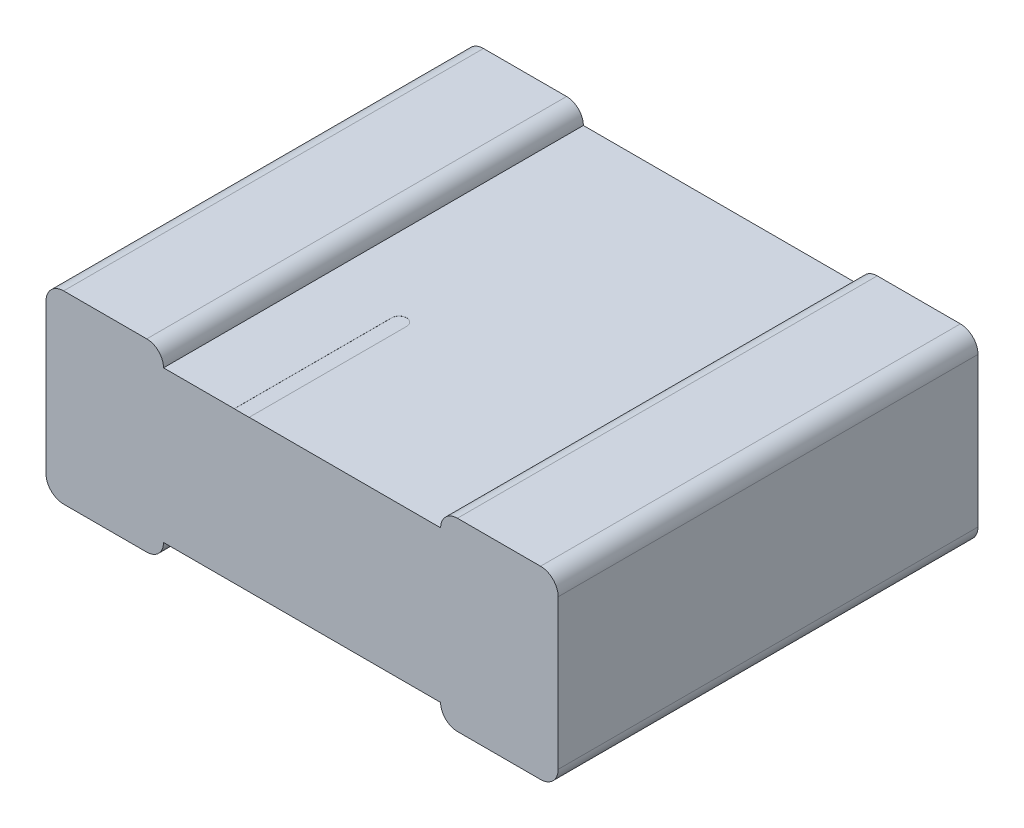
ISO-10303-21;
HEADER;
FILE_DESCRIPTION(('STEP AP214'),'2;1');
FILE_NAME('part.step','',(''),(''),'','','');
FILE_SCHEMA(('AUTOMOTIVE_DESIGN { 1 0 10303 214 1 1 1 1 }'));
ENDSEC;
DATA;
#1=APPLICATION_CONTEXT('core data for automotive mechanical design processes');
#2=APPLICATION_PROTOCOL_DEFINITION('international standard','automotive_design',2000,#1);
#3=PRODUCT_CONTEXT('',#1,'mechanical');
#4=PRODUCT('Part','Part','',(#3));
#5=PRODUCT_RELATED_PRODUCT_CATEGORY('part','',(#4));
#6=PRODUCT_DEFINITION_FORMATION('','',#4);
#7=PRODUCT_DEFINITION_CONTEXT('part definition',#1,'design');
#8=PRODUCT_DEFINITION('design','',#6,#7);
#9=PRODUCT_DEFINITION_SHAPE('','',#8);
#10=(LENGTH_UNIT() NAMED_UNIT(*) SI_UNIT(.MILLI.,.METRE.));
#11=(NAMED_UNIT(*) PLANE_ANGLE_UNIT() SI_UNIT($,.RADIAN.));
#12=(NAMED_UNIT(*) SI_UNIT($,.STERADIAN.) SOLID_ANGLE_UNIT());
#13=UNCERTAINTY_MEASURE_WITH_UNIT(LENGTH_MEASURE(1.E-05),#10,'distance_accuracy_value','');
#14=(GEOMETRIC_REPRESENTATION_CONTEXT(3) GLOBAL_UNCERTAINTY_ASSIGNED_CONTEXT((#13)) GLOBAL_UNIT_ASSIGNED_CONTEXT((#10,
#11,#12)) REPRESENTATION_CONTEXT('',''));
#15=CARTESIAN_POINT('',(0.,0.,0.));
#16=DIRECTION('',(0.,0.,1.));
#17=DIRECTION('',(1.,0.,0.));
#18=AXIS2_PLACEMENT_3D('',#15,#16,#17);
#19=CARTESIAN_POINT('',(0.,0.,0.));
#20=DIRECTION('',(0.,1.,0.));
#21=DIRECTION('',(0.,0.,1.));
#22=AXIS2_PLACEMENT_3D('',#19,#20,#21);
#23=PLANE('',#22);
#24=DIRECTION('',(0.,0.,1.));
#25=VECTOR('',#24,1.);
#26=CARTESIAN_POINT('',(0.4191,0.,-0.635));
#27=LINE('',#26,#25);
#28=CARTESIAN_POINT('',(0.4191,0.,0.635));
#29=VERTEX_POINT('',#28);
#30=CARTESIAN_POINT('',(0.4191,0.,-0.635));
#31=VERTEX_POINT('',#30);
#32=EDGE_CURVE('E377',#29,#31,#27,.F.);
#33=ORIENTED_EDGE('',*,*,#32,.F.);
#34=DIRECTION('',(1.,0.,0.));
#35=VECTOR('',#34,1.);
#36=CARTESIAN_POINT('',(-0.7239,0.,0.635));
#37=LINE('',#36,#35);
#38=CARTESIAN_POINT('',(-0.4191,0.,0.635));
#39=VERTEX_POINT('',#38);
#40=EDGE_CURVE('E475',#39,#29,#37,.T.);
#41=ORIENTED_EDGE('',*,*,#40,.F.);
#42=DIRECTION('',(0.,0.,1.));
#43=VECTOR('',#42,1.);
#44=CARTESIAN_POINT('',(-0.4191,0.,-0.635));
#45=LINE('',#44,#43);
#46=CARTESIAN_POINT('',(-0.4191,0.,-0.635));
#47=VERTEX_POINT('',#46);
#48=EDGE_CURVE('E463',#47,#39,#45,.T.);
#49=ORIENTED_EDGE('',*,*,#48,.F.);
#50=DIRECTION('',(-1.,0.,0.));
#51=VECTOR('',#50,1.);
#52=CARTESIAN_POINT('',(-0.7239,0.,-0.635));
#53=LINE('',#52,#51);
#54=EDGE_CURVE('E478',#31,#47,#53,.T.);
#55=ORIENTED_EDGE('',*,*,#54,.F.);
#56=EDGE_LOOP('',(#33,#41,#49,#55));
#57=FACE_BOUND('',#56,.T.);
#58=ADVANCED_FACE('F14',(#57),#23,.F.);
#59=CARTESIAN_POINT('',(-0.7239,0.4572,0.635));
#60=DIRECTION('',(0.,0.,-1.));
#61=DIRECTION('',(-1.,0.,0.));
#62=AXIS2_PLACEMENT_3D('',#59,#60,#61);
#63=PLANE('',#62);
#64=DIRECTION('',(1.,0.,0.));
#65=VECTOR('',#64,1.);
#66=CARTESIAN_POINT('',(-0.721360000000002,-0.0508000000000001,0.635));
#67=LINE('',#66,#65);
#68=CARTESIAN_POINT('',(-0.721360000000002,-0.0508000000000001,0.635));
#69=VERTEX_POINT('',#68);
#70=CARTESIAN_POINT('',(-0.469900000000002,-0.0508000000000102,0.635));
#71=VERTEX_POINT('',#70);
#72=EDGE_CURVE('E427',#69,#71,#67,.T.);
#73=ORIENTED_EDGE('',*,*,#72,.T.);
#74=CARTESIAN_POINT('',(-0.4699,0.,0.635));
#75=DIRECTION('',(0.,0.,-1.));
#76=DIRECTION('',(-1.,0.,0.));
#77=AXIS2_PLACEMENT_3D('',#74,#75,#76);
#78=CIRCLE('',#77,0.0508);
#79=EDGE_CURVE('E488',#71,#39,#78,.F.);
#80=ORIENTED_EDGE('',*,*,#79,.T.);
#81=ORIENTED_EDGE('',*,*,#40,.T.);
#82=CARTESIAN_POINT('',(0.4699,0.,0.635));
#83=DIRECTION('',(0.,0.,-1.));
#84=DIRECTION('',(-1.,0.,0.));
#85=AXIS2_PLACEMENT_3D('',#82,#83,#84);
#86=CIRCLE('',#85,0.0508);
#87=CARTESIAN_POINT('',(0.469900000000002,-0.0508000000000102,0.635));
#88=VERTEX_POINT('',#87);
#89=EDGE_CURVE('E490',#29,#88,#86,.F.);
#90=ORIENTED_EDGE('',*,*,#89,.T.);
#91=DIRECTION('',(-1.,0.,0.));
#92=VECTOR('',#91,1.);
#93=CARTESIAN_POINT('',(0.721360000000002,-0.0508000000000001,0.635));
#94=LINE('',#93,#92);
#95=CARTESIAN_POINT('',(0.721360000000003,-0.0508000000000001,0.635));
#96=VERTEX_POINT('',#95);
#97=EDGE_CURVE('E346',#96,#88,#94,.T.);
#98=ORIENTED_EDGE('',*,*,#97,.F.);
#99=CARTESIAN_POINT('',(0.72136,0.00254000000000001,0.635));
#100=DIRECTION('',(0.,0.,-1.));
#101=DIRECTION('',(1.,0.,0.));
#102=AXIS2_PLACEMENT_3D('',#99,#100,#101);
#103=CIRCLE('',#102,0.0533400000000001);
#104=CARTESIAN_POINT('',(0.7747,0.00254000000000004,0.635));
#105=VERTEX_POINT('',#104);
#106=EDGE_CURVE('E370',#105,#96,#103,.T.);
#107=ORIENTED_EDGE('',*,*,#106,.F.);
#108=DIRECTION('',(0.,-1.,0.));
#109=VECTOR('',#108,1.);
#110=CARTESIAN_POINT('',(0.7747,0.45466,0.635));
#111=LINE('',#110,#109);
#112=CARTESIAN_POINT('',(0.774699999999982,0.45466,0.635));
#113=VERTEX_POINT('',#112);
#114=EDGE_CURVE('E363',#113,#105,#111,.T.);
#115=ORIENTED_EDGE('',*,*,#114,.F.);
#116=CARTESIAN_POINT('',(0.72136,0.45466,0.635));
#117=DIRECTION('',(0.,0.,-1.));
#118=DIRECTION('',(3.638398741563E-13,1.,0.));
#119=AXIS2_PLACEMENT_3D('',#116,#117,#118);
#120=CIRCLE('',#119,0.053339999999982);
#121=CARTESIAN_POINT('',(0.72136,0.508,0.635));
#122=VERTEX_POINT('',#121);
#123=EDGE_CURVE('E356',#122,#113,#120,.T.);
#124=ORIENTED_EDGE('',*,*,#123,.F.);
#125=DIRECTION('',(1.,0.,0.));
#126=VECTOR('',#125,1.);
#127=CARTESIAN_POINT('',(0.4191,0.508,0.635));
#128=LINE('',#127,#126);
#129=CARTESIAN_POINT('',(0.469899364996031,0.508,0.635));
#130=VERTEX_POINT('',#129);
#131=EDGE_CURVE('E351',#130,#122,#128,.T.);
#132=ORIENTED_EDGE('',*,*,#131,.F.);
#133=CARTESIAN_POINT('',(0.469899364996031,0.4572,0.635));
#134=DIRECTION('',(0.,0.,-1.));
#135=DIRECTION('',(-1.,0.,0.));
#136=AXIS2_PLACEMENT_3D('',#133,#134,#135);
#137=CIRCLE('',#136,0.0508);
#138=CARTESIAN_POINT('',(0.4191,0.457454,0.635));
#139=VERTEX_POINT('',#138);
#140=EDGE_CURVE('E482',#130,#139,#137,.F.);
#141=ORIENTED_EDGE('',*,*,#140,.T.);
#142=DIRECTION('',(1.,0.,0.));
#143=VECTOR('',#142,1.);
#144=CARTESIAN_POINT('',(0.4191,0.457454,0.635));
#145=LINE('',#144,#143);
#146=CARTESIAN_POINT('',(-0.160003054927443,0.457454,0.635));
#147=VERTEX_POINT('',#146);
#148=EDGE_CURVE('E293',#147,#139,#145,.T.);
#149=ORIENTED_EDGE('',*,*,#148,.F.);
#150=DIRECTION('',(0.,-1.,0.));
#151=VECTOR('',#150,1.);
#152=CARTESIAN_POINT('',(-0.160003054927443,3.05727304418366,0.635));
#153=LINE('',#152,#151);
#154=CARTESIAN_POINT('',(-0.160003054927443,0.4572,0.635));
#155=VERTEX_POINT('',#154);
#156=EDGE_CURVE('E543',#147,#155,#153,.T.);
#157=ORIENTED_EDGE('',*,*,#156,.T.);
#158=DIRECTION('',(1.,0.,0.));
#159=VECTOR('',#158,1.);
#160=CARTESIAN_POINT('',(0.4191,0.4572,0.635));
#161=LINE('',#160,#159);
#162=CARTESIAN_POINT('',(-0.205099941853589,0.4572,0.635));
#163=VERTEX_POINT('',#162);
#164=EDGE_CURVE('E276',#163,#155,#161,.T.);
#165=ORIENTED_EDGE('',*,*,#164,.F.);
#166=DIRECTION('',(0.,-1.,0.));
#167=VECTOR('',#166,1.);
#168=CARTESIAN_POINT('',(-0.205099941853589,3.05727304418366,0.635));
#169=LINE('',#168,#167);
#170=CARTESIAN_POINT('',(-0.205099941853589,0.457454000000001,0.635));
#171=VERTEX_POINT('',#170);
#172=EDGE_CURVE('E267',#171,#163,#169,.T.);
#173=ORIENTED_EDGE('',*,*,#172,.F.);
#174=CARTESIAN_POINT('',(-0.4191,0.457454,0.635));
#175=VERTEX_POINT('',#174);
#176=EDGE_CURVE('E282',#175,#171,#145,.T.);
#177=ORIENTED_EDGE('',*,*,#176,.F.);
#178=CARTESIAN_POINT('',(-0.469899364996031,0.4572,0.635));
#179=DIRECTION('',(0.,0.,-1.));
#180=DIRECTION('',(-1.,0.,0.));
#181=AXIS2_PLACEMENT_3D('',#178,#179,#180);
#182=CIRCLE('',#181,0.0508);
#183=CARTESIAN_POINT('',(-0.469899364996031,0.508,0.635));
#184=VERTEX_POINT('',#183);
#185=EDGE_CURVE('E485',#175,#184,#182,.F.);
#186=ORIENTED_EDGE('',*,*,#185,.T.);
#187=DIRECTION('',(-1.,0.,0.));
#188=VECTOR('',#187,1.);
#189=CARTESIAN_POINT('',(-0.4191,0.508,0.635));
#190=LINE('',#189,#188);
#191=CARTESIAN_POINT('',(-0.72136,0.508,0.635));
#192=VERTEX_POINT('',#191);
#193=EDGE_CURVE('E393',#184,#192,#190,.T.);
#194=ORIENTED_EDGE('',*,*,#193,.T.);
#195=CARTESIAN_POINT('',(-0.72136,0.45466,0.635));
#196=DIRECTION('',(0.,0.,1.));
#197=DIRECTION('',(-3.638398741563E-13,1.,0.));
#198=AXIS2_PLACEMENT_3D('',#195,#196,#197);
#199=CIRCLE('',#198,0.053339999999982);
#200=CARTESIAN_POINT('',(-0.774699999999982,0.45466,0.635));
#201=VERTEX_POINT('',#200);
#202=EDGE_CURVE('E401',#192,#201,#199,.T.);
#203=ORIENTED_EDGE('',*,*,#202,.T.);
#204=DIRECTION('',(0.,-1.,0.));
#205=VECTOR('',#204,1.);
#206=CARTESIAN_POINT('',(-0.7747,0.45466,0.635));
#207=LINE('',#206,#205);
#208=CARTESIAN_POINT('',(-0.7747,0.00254000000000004,0.635));
#209=VERTEX_POINT('',#208);
#210=EDGE_CURVE('E411',#201,#209,#207,.T.);
#211=ORIENTED_EDGE('',*,*,#210,.T.);
#212=CARTESIAN_POINT('',(-0.72136,0.00254000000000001,0.635));
#213=DIRECTION('',(0.,0.,1.));
#214=DIRECTION('',(-1.,0.,0.));
#215=AXIS2_PLACEMENT_3D('',#212,#213,#214);
#216=CIRCLE('',#215,0.0533400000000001);
#217=EDGE_CURVE('E421',#209,#69,#216,.T.);
#218=ORIENTED_EDGE('',*,*,#217,.T.);
#219=EDGE_LOOP('',(#73,#80,#81,#90,#98,#107,#115,#124,#132,#141,#149,#157,#165,#173,#177,#186,
#194,#203,#211,#218));
#220=FACE_BOUND('',#219,.T.);
#221=ADVANCED_FACE('F281',(#220),#63,.F.);
#222=CARTESIAN_POINT('',(-0.7239,0.4572,-0.635));
#223=DIRECTION('',(0.,0.,1.));
#224=DIRECTION('',(1.,0.,0.));
#225=AXIS2_PLACEMENT_3D('',#222,#223,#224);
#226=PLANE('',#225);
#227=DIRECTION('',(-1.,0.,0.));
#228=VECTOR('',#227,1.);
#229=CARTESIAN_POINT('',(0.721360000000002,-0.0508000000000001,-0.635));
#230=LINE('',#229,#228);
#231=CARTESIAN_POINT('',(0.721360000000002,-0.0508000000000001,-0.635));
#232=VERTEX_POINT('',#231);
#233=CARTESIAN_POINT('',(0.469900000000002,-0.0508000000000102,-0.635));
#234=VERTEX_POINT('',#233);
#235=EDGE_CURVE('E342',#232,#234,#230,.T.);
#236=ORIENTED_EDGE('',*,*,#235,.T.);
#237=CARTESIAN_POINT('',(0.4699,0.,-0.635));
#238=DIRECTION('',(0.,0.,1.));
#239=DIRECTION('',(1.,0.,0.));
#240=AXIS2_PLACEMENT_3D('',#237,#238,#239);
#241=CIRCLE('',#240,0.0508);
#242=EDGE_CURVE('E503',#234,#31,#241,.F.);
#243=ORIENTED_EDGE('',*,*,#242,.T.);
#244=ORIENTED_EDGE('',*,*,#54,.T.);
#245=CARTESIAN_POINT('',(-0.4699,0.,-0.635));
#246=DIRECTION('',(0.,0.,1.));
#247=DIRECTION('',(1.,0.,0.));
#248=AXIS2_PLACEMENT_3D('',#245,#246,#247);
#249=CIRCLE('',#248,0.0508);
#250=CARTESIAN_POINT('',(-0.469900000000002,-0.0508000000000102,-0.635));
#251=VERTEX_POINT('',#250);
#252=EDGE_CURVE('E500',#47,#251,#249,.F.);
#253=ORIENTED_EDGE('',*,*,#252,.T.);
#254=DIRECTION('',(1.,0.,0.));
#255=VECTOR('',#254,1.);
#256=CARTESIAN_POINT('',(-0.721360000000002,-0.0508000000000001,-0.635));
#257=LINE('',#256,#255);
#258=CARTESIAN_POINT('',(-0.721360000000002,-0.0508000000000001,-0.635));
#259=VERTEX_POINT('',#258);
#260=EDGE_CURVE('E431',#259,#251,#257,.T.);
#261=ORIENTED_EDGE('',*,*,#260,.F.);
#262=CARTESIAN_POINT('',(-0.72136,0.00254000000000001,-0.635));
#263=DIRECTION('',(0.,0.,1.));
#264=DIRECTION('',(-1.,0.,0.));
#265=AXIS2_PLACEMENT_3D('',#262,#263,#264);
#266=CIRCLE('',#265,0.0533400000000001);
#267=CARTESIAN_POINT('',(-0.7747,0.00254000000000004,-0.635));
#268=VERTEX_POINT('',#267);
#269=EDGE_CURVE('E456',#268,#259,#266,.T.);
#270=ORIENTED_EDGE('',*,*,#269,.F.);
#271=DIRECTION('',(0.,-1.,0.));
#272=VECTOR('',#271,1.);
#273=CARTESIAN_POINT('',(-0.7747,0.45466,-0.635));
#274=LINE('',#273,#272);
#275=CARTESIAN_POINT('',(-0.774699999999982,0.45466,-0.635));
#276=VERTEX_POINT('',#275);
#277=EDGE_CURVE('E449',#276,#268,#274,.T.);
#278=ORIENTED_EDGE('',*,*,#277,.F.);
#279=CARTESIAN_POINT('',(-0.72136,0.45466,-0.635));
#280=DIRECTION('',(0.,0.,1.));
#281=DIRECTION('',(-3.638398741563E-13,1.,0.));
#282=AXIS2_PLACEMENT_3D('',#279,#280,#281);
#283=CIRCLE('',#282,0.053339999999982);
#284=CARTESIAN_POINT('',(-0.72136,0.508,-0.635));
#285=VERTEX_POINT('',#284);
#286=EDGE_CURVE('E442',#285,#276,#283,.T.);
#287=ORIENTED_EDGE('',*,*,#286,.F.);
#288=DIRECTION('',(-1.,0.,0.));
#289=VECTOR('',#288,1.);
#290=CARTESIAN_POINT('',(-0.4191,0.508,-0.635));
#291=LINE('',#290,#289);
#292=CARTESIAN_POINT('',(-0.469899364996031,0.508,-0.635));
#293=VERTEX_POINT('',#292);
#294=EDGE_CURVE('E436',#293,#285,#291,.T.);
#295=ORIENTED_EDGE('',*,*,#294,.F.);
#296=CARTESIAN_POINT('',(-0.469899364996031,0.4572,-0.635));
#297=DIRECTION('',(0.,0.,1.));
#298=DIRECTION('',(1.,0.,0.));
#299=AXIS2_PLACEMENT_3D('',#296,#297,#298);
#300=CIRCLE('',#299,0.0508);
#301=CARTESIAN_POINT('',(-0.4191,0.457454,-0.635));
#302=VERTEX_POINT('',#301);
#303=EDGE_CURVE('E45',#293,#302,#300,.F.);
#304=ORIENTED_EDGE('',*,*,#303,.T.);
#305=DIRECTION('',(-1.,0.,0.));
#306=VECTOR('',#305,1.);
#307=CARTESIAN_POINT('',(0.4191,0.457454,-0.635));
#308=LINE('',#307,#306);
#309=CARTESIAN_POINT('',(0.4191,0.457454,-0.635));
#310=VERTEX_POINT('',#309);
#311=EDGE_CURVE('E525',#310,#302,#308,.T.);
#312=ORIENTED_EDGE('',*,*,#311,.F.);
#313=CARTESIAN_POINT('',(0.469899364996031,0.4572,-0.635));
#314=DIRECTION('',(0.,0.,1.));
#315=DIRECTION('',(1.,0.,0.));
#316=AXIS2_PLACEMENT_3D('',#313,#314,#315);
#317=CIRCLE('',#316,0.0508);
#318=CARTESIAN_POINT('',(0.469899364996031,0.508,-0.635));
#319=VERTEX_POINT('',#318);
#320=EDGE_CURVE('E35',#310,#319,#317,.F.);
#321=ORIENTED_EDGE('',*,*,#320,.T.);
#322=DIRECTION('',(1.,0.,0.));
#323=VECTOR('',#322,1.);
#324=CARTESIAN_POINT('',(0.4191,0.508,-0.635));
#325=LINE('',#324,#323);
#326=CARTESIAN_POINT('',(0.72136,0.508,-0.635));
#327=VERTEX_POINT('',#326);
#328=EDGE_CURVE('E302',#319,#327,#325,.T.);
#329=ORIENTED_EDGE('',*,*,#328,.T.);
#330=CARTESIAN_POINT('',(0.72136,0.45466,-0.635));
#331=DIRECTION('',(0.,0.,-1.));
#332=DIRECTION('',(3.638398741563E-13,1.,0.));
#333=AXIS2_PLACEMENT_3D('',#330,#331,#332);
#334=CIRCLE('',#333,0.053339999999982);
#335=CARTESIAN_POINT('',(0.774699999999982,0.45466,-0.635));
#336=VERTEX_POINT('',#335);
#337=EDGE_CURVE('E316',#327,#336,#334,.T.);
#338=ORIENTED_EDGE('',*,*,#337,.T.);
#339=DIRECTION('',(0.,-1.,0.));
#340=VECTOR('',#339,1.);
#341=CARTESIAN_POINT('',(0.7747,0.45466,-0.635));
#342=LINE('',#341,#340);
#343=CARTESIAN_POINT('',(0.7747,0.00254000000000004,-0.635));
#344=VERTEX_POINT('',#343);
#345=EDGE_CURVE('E326',#336,#344,#342,.T.);
#346=ORIENTED_EDGE('',*,*,#345,.T.);
#347=CARTESIAN_POINT('',(0.72136,0.00254000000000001,-0.635));
#348=DIRECTION('',(0.,0.,-1.));
#349=DIRECTION('',(1.,0.,0.));
#350=AXIS2_PLACEMENT_3D('',#347,#348,#349);
#351=CIRCLE('',#350,0.0533400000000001);
#352=EDGE_CURVE('E336',#344,#232,#351,.T.);
#353=ORIENTED_EDGE('',*,*,#352,.T.);
#354=EDGE_LOOP('',(#236,#243,#244,#253,#261,#270,#278,#287,#295,#304,#312,#321,#329,#338,#346,#353));
#355=FACE_BOUND('',#354,.T.);
#356=ADVANCED_FACE('F518',(#355),#226,.F.);
#357=CARTESIAN_POINT('',(-0.4191,0.508,-0.635));
#358=DIRECTION('',(0.,1.,0.));
#359=DIRECTION('',(-1.,0.,0.));
#360=AXIS2_PLACEMENT_3D('',#357,#358,#359);
#361=PLANE('',#360);
#362=ORIENTED_EDGE('',*,*,#193,.F.);
#363=DIRECTION('',(0.,0.,1.));
#364=VECTOR('',#363,1.);
#365=CARTESIAN_POINT('',(-0.469899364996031,0.508,-0.635));
#366=LINE('',#365,#364);
#367=EDGE_CURVE('E23',#184,#293,#366,.F.);
#368=ORIENTED_EDGE('',*,*,#367,.T.);
#369=ORIENTED_EDGE('',*,*,#294,.T.);
#370=DIRECTION('',(0.,0.,-1.));
#371=VECTOR('',#370,1.);
#372=CARTESIAN_POINT('',(-0.72136,0.508,-0.635));
#373=LINE('',#372,#371);
#374=EDGE_CURVE('E396',#192,#285,#373,.T.);
#375=ORIENTED_EDGE('',*,*,#374,.F.);
#376=EDGE_LOOP('',(#362,#368,#369,#375));
#377=FACE_BOUND('',#376,.T.);
#378=ADVANCED_FACE('F514',(#377),#361,.T.);
#379=CARTESIAN_POINT('',(-0.72136,0.45466,-0.635));
#380=DIRECTION('',(0.,0.,1.));
#381=DIRECTION('',(1.,0.,0.));
#382=AXIS2_PLACEMENT_3D('',#379,#380,#381);
#383=CYLINDRICAL_SURFACE('',#382,0.053339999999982);
#384=ORIENTED_EDGE('',*,*,#286,.T.);
#385=DIRECTION('',(0.,0.,-1.));
#386=VECTOR('',#385,1.);
#387=CARTESIAN_POINT('',(-0.7747,0.45466,-0.635));
#388=LINE('',#387,#386);
#389=EDGE_CURVE('E406',#201,#276,#388,.T.);
#390=ORIENTED_EDGE('',*,*,#389,.F.);
#391=ORIENTED_EDGE('',*,*,#202,.F.);
#392=ORIENTED_EDGE('',*,*,#374,.T.);
#393=EDGE_LOOP('',(#384,#390,#391,#392));
#394=FACE_BOUND('',#393,.T.);
#395=ADVANCED_FACE('F521',(#394),#383,.T.);
#396=CARTESIAN_POINT('',(-0.7747,0.45466,-0.635));
#397=DIRECTION('',(-1.,0.,0.));
#398=DIRECTION('',(0.,-1.,0.));
#399=AXIS2_PLACEMENT_3D('',#396,#397,#398);
#400=PLANE('',#399);
#401=ORIENTED_EDGE('',*,*,#277,.T.);
#402=DIRECTION('',(0.,0.,-1.));
#403=VECTOR('',#402,1.);
#404=CARTESIAN_POINT('',(-0.7747,0.00254000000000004,-0.635));
#405=LINE('',#404,#403);
#406=EDGE_CURVE('E416',#209,#268,#405,.T.);
#407=ORIENTED_EDGE('',*,*,#406,.F.);
#408=ORIENTED_EDGE('',*,*,#210,.F.);
#409=ORIENTED_EDGE('',*,*,#389,.T.);
#410=EDGE_LOOP('',(#401,#407,#408,#409));
#411=FACE_BOUND('',#410,.T.);
#412=ADVANCED_FACE('F610',(#411),#400,.T.);
#413=CARTESIAN_POINT('',(-0.72136,0.00254000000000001,-0.635));
#414=DIRECTION('',(0.,0.,1.));
#415=DIRECTION('',(1.,0.,0.));
#416=AXIS2_PLACEMENT_3D('',#413,#414,#415);
#417=CYLINDRICAL_SURFACE('',#416,0.0533400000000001);
#418=ORIENTED_EDGE('',*,*,#269,.T.);
#419=DIRECTION('',(0.,0.,-1.));
#420=VECTOR('',#419,1.);
#421=CARTESIAN_POINT('',(-0.721360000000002,-0.0508000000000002,-0.635));
#422=LINE('',#421,#420);
#423=EDGE_CURVE('E426',#69,#259,#422,.T.);
#424=ORIENTED_EDGE('',*,*,#423,.F.);
#425=ORIENTED_EDGE('',*,*,#217,.F.);
#426=ORIENTED_EDGE('',*,*,#406,.T.);
#427=EDGE_LOOP('',(#418,#424,#425,#426));
#428=FACE_BOUND('',#427,.T.);
#429=ADVANCED_FACE('F607',(#428),#417,.T.);
#430=CARTESIAN_POINT('',(-0.721360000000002,-0.0508000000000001,-0.635));
#431=DIRECTION('',(0.,-1.,0.));
#432=DIRECTION('',(1.,0.,0.));
#433=AXIS2_PLACEMENT_3D('',#430,#431,#432);
#434=PLANE('',#433);
#435=ORIENTED_EDGE('',*,*,#260,.T.);
#436=DIRECTION('',(0.,0.,-1.));
#437=VECTOR('',#436,1.);
#438=CARTESIAN_POINT('',(-0.469900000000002,-0.0508000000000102,0.635));
#439=LINE('',#438,#437);
#440=EDGE_CURVE('E506',#251,#71,#439,.F.);
#441=ORIENTED_EDGE('',*,*,#440,.T.);
#442=ORIENTED_EDGE('',*,*,#72,.F.);
#443=ORIENTED_EDGE('',*,*,#423,.T.);
#444=EDGE_LOOP('',(#435,#441,#442,#443));
#445=FACE_BOUND('',#444,.T.);
#446=ADVANCED_FACE('F604',(#445),#434,.T.);
#447=CARTESIAN_POINT('',(0.4191,0.508,-0.635));
#448=DIRECTION('',(0.,1.,0.));
#449=DIRECTION('',(-1.,0.,0.));
#450=AXIS2_PLACEMENT_3D('',#447,#448,#449);
#451=PLANE('',#450);
#452=ORIENTED_EDGE('',*,*,#328,.F.);
#453=DIRECTION('',(0.,0.,-1.));
#454=VECTOR('',#453,1.);
#455=CARTESIAN_POINT('',(0.469899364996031,0.508,0.635));
#456=LINE('',#455,#454);
#457=EDGE_CURVE('E9',#319,#130,#456,.F.);
#458=ORIENTED_EDGE('',*,*,#457,.T.);
#459=ORIENTED_EDGE('',*,*,#131,.T.);
#460=DIRECTION('',(0.,0.,-1.));
#461=VECTOR('',#460,1.);
#462=CARTESIAN_POINT('',(0.72136,0.508,-0.635));
#463=LINE('',#462,#461);
#464=EDGE_CURVE('E311',#327,#122,#463,.F.);
#465=ORIENTED_EDGE('',*,*,#464,.F.);
#466=EDGE_LOOP('',(#452,#458,#459,#465));
#467=FACE_BOUND('',#466,.T.);
#468=ADVANCED_FACE('F577',(#467),#451,.T.);
#469=CARTESIAN_POINT('',(0.72136,0.45466,-0.635));
#470=DIRECTION('',(0.,0.,-1.));
#471=DIRECTION('',(-1.,0.,0.));
#472=AXIS2_PLACEMENT_3D('',#469,#470,#471);
#473=CYLINDRICAL_SURFACE('',#472,0.053339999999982);
#474=ORIENTED_EDGE('',*,*,#123,.T.);
#475=DIRECTION('',(0.,0.,-1.));
#476=VECTOR('',#475,1.);
#477=CARTESIAN_POINT('',(0.7747,0.45466,-0.635));
#478=LINE('',#477,#476);
#479=EDGE_CURVE('E321',#336,#113,#478,.F.);
#480=ORIENTED_EDGE('',*,*,#479,.F.);
#481=ORIENTED_EDGE('',*,*,#337,.F.);
#482=ORIENTED_EDGE('',*,*,#464,.T.);
#483=EDGE_LOOP('',(#474,#480,#481,#482));
#484=FACE_BOUND('',#483,.T.);
#485=ADVANCED_FACE('F583',(#484),#473,.T.);
#486=CARTESIAN_POINT('',(0.7747,0.45466,-0.635));
#487=DIRECTION('',(1.,0.,0.));
#488=DIRECTION('',(0.,0.,-1.));
#489=AXIS2_PLACEMENT_3D('',#486,#487,#488);
#490=PLANE('',#489);
#491=ORIENTED_EDGE('',*,*,#114,.T.);
#492=DIRECTION('',(0.,0.,-1.));
#493=VECTOR('',#492,1.);
#494=CARTESIAN_POINT('',(0.7747,0.00254000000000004,-0.635));
#495=LINE('',#494,#493);
#496=EDGE_CURVE('E331',#344,#105,#495,.F.);
#497=ORIENTED_EDGE('',*,*,#496,.F.);
#498=ORIENTED_EDGE('',*,*,#345,.F.);
#499=ORIENTED_EDGE('',*,*,#479,.T.);
#500=EDGE_LOOP('',(#491,#497,#498,#499));
#501=FACE_BOUND('',#500,.T.);
#502=ADVANCED_FACE('F659',(#501),#490,.T.);
#503=CARTESIAN_POINT('',(0.72136,0.00254000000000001,-0.635));
#504=DIRECTION('',(0.,0.,-1.));
#505=DIRECTION('',(-1.,0.,0.));
#506=AXIS2_PLACEMENT_3D('',#503,#504,#505);
#507=CYLINDRICAL_SURFACE('',#506,0.0533400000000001);
#508=ORIENTED_EDGE('',*,*,#106,.T.);
#509=DIRECTION('',(0.,0.,-1.));
#510=VECTOR('',#509,1.);
#511=CARTESIAN_POINT('',(0.721360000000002,-0.0508000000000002,-0.635));
#512=LINE('',#511,#510);
#513=EDGE_CURVE('E341',#232,#96,#512,.F.);
#514=ORIENTED_EDGE('',*,*,#513,.F.);
#515=ORIENTED_EDGE('',*,*,#352,.F.);
#516=ORIENTED_EDGE('',*,*,#496,.T.);
#517=EDGE_LOOP('',(#508,#514,#515,#516));
#518=FACE_BOUND('',#517,.T.);
#519=ADVANCED_FACE('F663',(#518),#507,.T.);
#520=CARTESIAN_POINT('',(0.721360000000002,-0.0508000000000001,-0.635));
#521=DIRECTION('',(0.,-1.,0.));
#522=DIRECTION('',(1.,0.,0.));
#523=AXIS2_PLACEMENT_3D('',#520,#521,#522);
#524=PLANE('',#523);
#525=ORIENTED_EDGE('',*,*,#97,.T.);
#526=DIRECTION('',(0.,0.,1.));
#527=VECTOR('',#526,1.);
#528=CARTESIAN_POINT('',(0.469900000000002,-0.0508000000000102,-0.635));
#529=LINE('',#528,#527);
#530=EDGE_CURVE('E493',#88,#234,#529,.F.);
#531=ORIENTED_EDGE('',*,*,#530,.T.);
#532=ORIENTED_EDGE('',*,*,#235,.F.);
#533=ORIENTED_EDGE('',*,*,#513,.T.);
#534=EDGE_LOOP('',(#525,#531,#532,#533));
#535=FACE_BOUND('',#534,.T.);
#536=ADVANCED_FACE('F693',(#535),#524,.T.);
#537=CARTESIAN_POINT('',(0.,0.457454,0.));
#538=DIRECTION('',(0.,-1.,0.));
#539=DIRECTION('',(0.,0.,-1.));
#540=AXIS2_PLACEMENT_3D('',#537,#538,#539);
#541=PLANE('',#540);
#542=ORIENTED_EDGE('',*,*,#176,.T.);
#543=DIRECTION('',(0.,0.,1.));
#544=VECTOR('',#543,1.);
#545=CARTESIAN_POINT('',(-0.205099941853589,0.457454,0.635));
#546=LINE('',#545,#544);
#547=CARTESIAN_POINT('',(-0.205099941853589,0.457454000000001,0.158817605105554));
#548=VERTEX_POINT('',#547);
#549=EDGE_CURVE('E263',#548,#171,#546,.T.);
#550=ORIENTED_EDGE('',*,*,#549,.F.);
#551=CARTESIAN_POINT('',(-0.182551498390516,0.457454,0.158817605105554));
#552=DIRECTION('',(0.,-1.,0.));
#553=DIRECTION('',(0.,0.,-1.));
#554=AXIS2_PLACEMENT_3D('',#551,#552,#553);
#555=CIRCLE('',#554,0.022548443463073);
#556=CARTESIAN_POINT('',(-0.160003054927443,0.457454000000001,0.158817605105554));
#557=VERTEX_POINT('',#556);
#558=EDGE_CURVE('E275',#557,#548,#555,.F.);
#559=ORIENTED_EDGE('',*,*,#558,.F.);
#560=DIRECTION('',(0.,0.,-1.));
#561=VECTOR('',#560,1.);
#562=CARTESIAN_POINT('',(-0.160003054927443,0.457454,0.635));
#563=LINE('',#562,#561);
#564=EDGE_CURVE('E547',#147,#557,#563,.T.);
#565=ORIENTED_EDGE('',*,*,#564,.F.);
#566=ORIENTED_EDGE('',*,*,#148,.T.);
#567=DIRECTION('',(0.,0.,-1.));
#568=VECTOR('',#567,1.);
#569=CARTESIAN_POINT('',(0.4191,0.457454,-0.635));
#570=LINE('',#569,#568);
#571=EDGE_CURVE('E286',#139,#310,#570,.T.);
#572=ORIENTED_EDGE('',*,*,#571,.T.);
#573=ORIENTED_EDGE('',*,*,#311,.T.);
#574=DIRECTION('',(0.,0.,1.));
#575=VECTOR('',#574,1.);
#576=CARTESIAN_POINT('',(-0.4191,0.457454,-0.635));
#577=LINE('',#576,#575);
#578=EDGE_CURVE('E290',#302,#175,#577,.T.);
#579=ORIENTED_EDGE('',*,*,#578,.T.);
#580=EDGE_LOOP('',(#542,#550,#559,#565,#566,#572,#573,#579));
#581=FACE_BOUND('',#580,.T.);
#582=ADVANCED_FACE('F288',(#581),#541,.F.);
#583=CARTESIAN_POINT('',(-0.205099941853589,3.05727304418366,0.635));
#584=DIRECTION('',(-1.,0.,0.));
#585=DIRECTION('',(0.,0.,1.));
#586=AXIS2_PLACEMENT_3D('',#583,#584,#585);
#587=PLANE('',#586);
#588=ORIENTED_EDGE('',*,*,#549,.T.);
#589=ORIENTED_EDGE('',*,*,#172,.T.);
#590=DIRECTION('',(0.,0.,1.));
#591=VECTOR('',#590,1.);
#592=CARTESIAN_POINT('',(-0.205099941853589,0.4572,0.635));
#593=LINE('',#592,#591);
#594=CARTESIAN_POINT('',(-0.205099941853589,0.4572,0.158817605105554));
#595=VERTEX_POINT('',#594);
#596=EDGE_CURVE('E546',#595,#163,#593,.T.);
#597=ORIENTED_EDGE('',*,*,#596,.F.);
#598=DIRECTION('',(0.,-1.,0.));
#599=VECTOR('',#598,1.);
#600=CARTESIAN_POINT('',(-0.205099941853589,3.05727304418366,0.158817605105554));
#601=LINE('',#600,#599);
#602=EDGE_CURVE('E270',#548,#595,#601,.T.);
#603=ORIENTED_EDGE('',*,*,#602,.F.);
#604=EDGE_LOOP('',(#588,#589,#597,#603));
#605=FACE_BOUND('',#604,.T.);
#606=ADVANCED_FACE('F265',(#605),#587,.F.);
#607=CARTESIAN_POINT('',(-0.182551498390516,3.05727304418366,0.158817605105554));
#608=DIRECTION('',(0.,-1.,0.));
#609=DIRECTION('',(0.,0.,-1.));
#610=AXIS2_PLACEMENT_3D('',#607,#608,#609);
#611=CYLINDRICAL_SURFACE('',#610,0.022548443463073);
#612=ORIENTED_EDGE('',*,*,#558,.T.);
#613=ORIENTED_EDGE('',*,*,#602,.T.);
#614=CARTESIAN_POINT('',(-0.182551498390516,0.4572,0.158817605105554));
#615=DIRECTION('',(0.,-1.,0.));
#616=DIRECTION('',(0.,0.,-1.));
#617=AXIS2_PLACEMENT_3D('',#614,#615,#616);
#618=CIRCLE('',#617,0.022548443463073);
#619=CARTESIAN_POINT('',(-0.160003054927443,0.4572,0.158817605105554));
#620=VERTEX_POINT('',#619);
#621=EDGE_CURVE('E553',#620,#595,#618,.F.);
#622=ORIENTED_EDGE('',*,*,#621,.F.);
#623=DIRECTION('',(0.,-1.,0.));
#624=VECTOR('',#623,1.);
#625=CARTESIAN_POINT('',(-0.160003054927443,3.05727304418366,0.158817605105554));
#626=LINE('',#625,#624);
#627=EDGE_CURVE('E539',#557,#620,#626,.T.);
#628=ORIENTED_EDGE('',*,*,#627,.F.);
#629=EDGE_LOOP('',(#612,#613,#622,#628));
#630=FACE_BOUND('',#629,.T.);
#631=ADVANCED_FACE('F567',(#630),#611,.F.);
#632=CARTESIAN_POINT('',(-0.160003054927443,3.05727304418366,0.635));
#633=DIRECTION('',(1.,0.,0.));
#634=DIRECTION('',(0.,0.,-1.));
#635=AXIS2_PLACEMENT_3D('',#632,#633,#634);
#636=PLANE('',#635);
#637=ORIENTED_EDGE('',*,*,#564,.T.);
#638=ORIENTED_EDGE('',*,*,#627,.T.);
#639=DIRECTION('',(0.,0.,-1.));
#640=VECTOR('',#639,1.);
#641=CARTESIAN_POINT('',(-0.160003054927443,0.4572,0.635));
#642=LINE('',#641,#640);
#643=EDGE_CURVE('E550',#155,#620,#642,.T.);
#644=ORIENTED_EDGE('',*,*,#643,.F.);
#645=ORIENTED_EDGE('',*,*,#156,.F.);
#646=EDGE_LOOP('',(#637,#638,#644,#645));
#647=FACE_BOUND('',#646,.T.);
#648=ADVANCED_FACE('F923',(#647),#636,.F.);
#649=CARTESIAN_POINT('',(0.,0.4572,0.));
#650=DIRECTION('',(0.,-1.,0.));
#651=DIRECTION('',(0.,0.,-1.));
#652=AXIS2_PLACEMENT_3D('',#649,#650,#651);
#653=PLANE('',#652);
#654=ORIENTED_EDGE('',*,*,#643,.T.);
#655=ORIENTED_EDGE('',*,*,#621,.T.);
#656=ORIENTED_EDGE('',*,*,#596,.T.);
#657=ORIENTED_EDGE('',*,*,#164,.T.);
#658=EDGE_LOOP('',(#654,#655,#656,#657));
#659=FACE_BOUND('',#658,.T.);
#660=ADVANCED_FACE('F562',(#659),#653,.F.);
#661=CARTESIAN_POINT('',(0.4699,0.,0.));
#662=DIRECTION('',(0.,0.,-1.));
#663=DIRECTION('',(-1.,0.,0.));
#664=AXIS2_PLACEMENT_3D('',#661,#662,#663);
#665=CYLINDRICAL_SURFACE('',#664,0.0508);
#666=ORIENTED_EDGE('',*,*,#242,.F.);
#667=ORIENTED_EDGE('',*,*,#530,.F.);
#668=ORIENTED_EDGE('',*,*,#89,.F.);
#669=ORIENTED_EDGE('',*,*,#32,.T.);
#670=EDGE_LOOP('',(#666,#667,#668,#669));
#671=FACE_BOUND('',#670,.T.);
#672=ADVANCED_FACE('F593',(#671),#665,.T.);
#673=CARTESIAN_POINT('',(-0.4699,0.,0.));
#674=DIRECTION('',(0.,0.,1.));
#675=DIRECTION('',(1.,0.,0.));
#676=AXIS2_PLACEMENT_3D('',#673,#674,#675);
#677=CYLINDRICAL_SURFACE('',#676,0.0508);
#678=ORIENTED_EDGE('',*,*,#79,.F.);
#679=ORIENTED_EDGE('',*,*,#440,.F.);
#680=ORIENTED_EDGE('',*,*,#252,.F.);
#681=ORIENTED_EDGE('',*,*,#48,.T.);
#682=EDGE_LOOP('',(#678,#679,#680,#681));
#683=FACE_BOUND('',#682,.T.);
#684=ADVANCED_FACE('F601',(#683),#677,.T.);
#685=CARTESIAN_POINT('',(-0.469899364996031,0.4572,0.));
#686=DIRECTION('',(0.,0.,-1.));
#687=DIRECTION('',(-1.,0.,0.));
#688=AXIS2_PLACEMENT_3D('',#685,#686,#687);
#689=CYLINDRICAL_SURFACE('',#688,0.0508);
#690=ORIENTED_EDGE('',*,*,#185,.F.);
#691=ORIENTED_EDGE('',*,*,#578,.F.);
#692=ORIENTED_EDGE('',*,*,#303,.F.);
#693=ORIENTED_EDGE('',*,*,#367,.F.);
#694=EDGE_LOOP('',(#690,#691,#692,#693));
#695=FACE_BOUND('',#694,.T.);
#696=ADVANCED_FACE('F523',(#695),#689,.T.);
#697=CARTESIAN_POINT('',(0.469899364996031,0.4572,0.));
#698=DIRECTION('',(0.,0.,1.));
#699=DIRECTION('',(1.,0.,0.));
#700=AXIS2_PLACEMENT_3D('',#697,#698,#699);
#701=CYLINDRICAL_SURFACE('',#700,0.0508);
#702=ORIENTED_EDGE('',*,*,#320,.F.);
#703=ORIENTED_EDGE('',*,*,#571,.F.);
#704=ORIENTED_EDGE('',*,*,#140,.F.);
#705=ORIENTED_EDGE('',*,*,#457,.F.);
#706=EDGE_LOOP('',(#702,#703,#704,#705));
#707=FACE_BOUND('',#706,.T.);
#708=ADVANCED_FACE('F16',(#707),#701,.T.);
#709=CLOSED_SHELL('',(#58,#221,#356,#378,#395,#412,#429,#446,#468,#485,#502,#519,#536,#582,#606,
#631,#648,#660,#672,#684,#696,#708));
#710=MANIFOLD_SOLID_BREP('B1',#709);
#711=ADVANCED_BREP_SHAPE_REPRESENTATION('',(#18,#710),#14);
#712=SHAPE_DEFINITION_REPRESENTATION(#9,#711);
ENDSEC;
END-ISO-10303-21;
